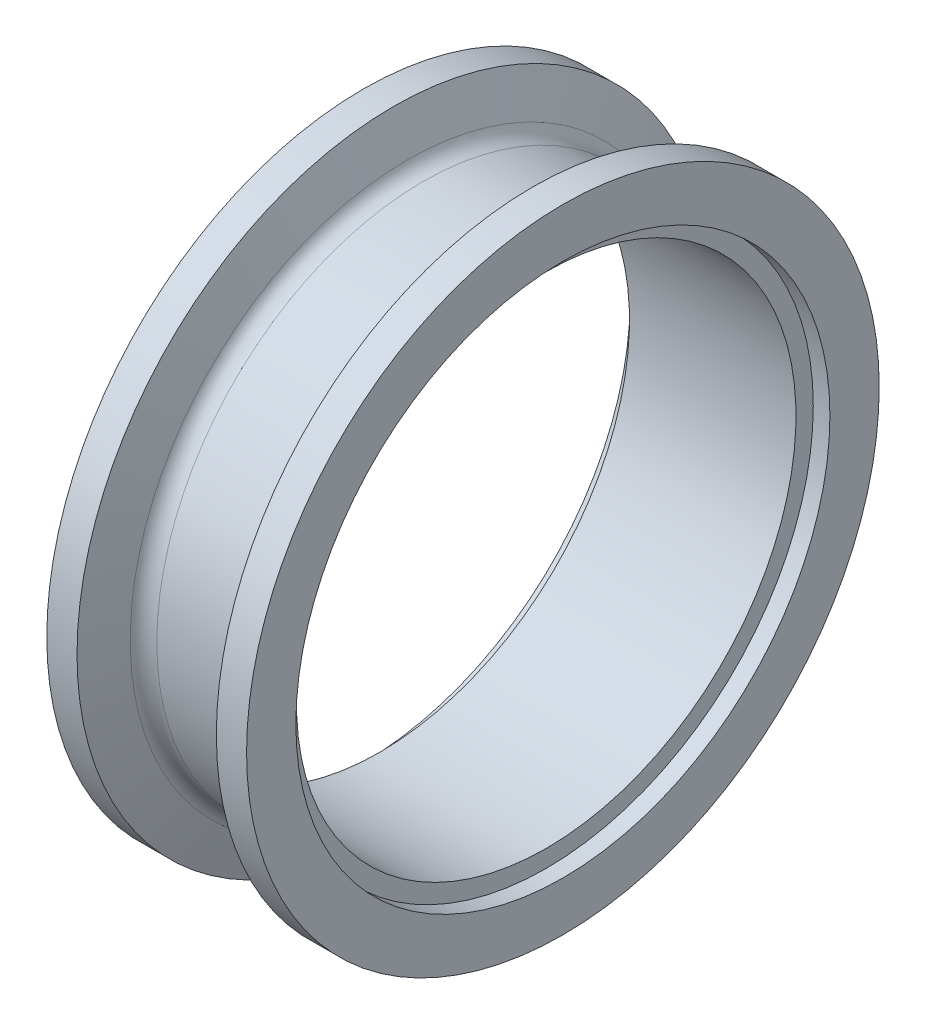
ISO-10303-21;
HEADER;
FILE_DESCRIPTION(('STEP AP214'),'2;1');
FILE_NAME('part.step','',(''),(''),'','','');
FILE_SCHEMA(('AUTOMOTIVE_DESIGN { 1 0 10303 214 1 1 1 1 }'));
ENDSEC;
DATA;
#1=APPLICATION_CONTEXT('core data for automotive mechanical design processes');
#2=APPLICATION_PROTOCOL_DEFINITION('international standard','automotive_design',2000,#1);
#3=PRODUCT_CONTEXT('',#1,'mechanical');
#4=PRODUCT('Part','Part','',(#3));
#5=PRODUCT_RELATED_PRODUCT_CATEGORY('part','',(#4));
#6=PRODUCT_DEFINITION_FORMATION('','',#4);
#7=PRODUCT_DEFINITION_CONTEXT('part definition',#1,'design');
#8=PRODUCT_DEFINITION('design','',#6,#7);
#9=PRODUCT_DEFINITION_SHAPE('','',#8);
#10=(LENGTH_UNIT() NAMED_UNIT(*) SI_UNIT(.MILLI.,.METRE.));
#11=(NAMED_UNIT(*) PLANE_ANGLE_UNIT() SI_UNIT($,.RADIAN.));
#12=(NAMED_UNIT(*) SI_UNIT($,.STERADIAN.) SOLID_ANGLE_UNIT());
#13=UNCERTAINTY_MEASURE_WITH_UNIT(LENGTH_MEASURE(1.E-05),#10,'distance_accuracy_value','');
#14=(GEOMETRIC_REPRESENTATION_CONTEXT(3) GLOBAL_UNCERTAINTY_ASSIGNED_CONTEXT((#13)) GLOBAL_UNIT_ASSIGNED_CONTEXT((#10,
#11,#12)) REPRESENTATION_CONTEXT('',''));
#15=CARTESIAN_POINT('',(0.,0.,0.));
#16=DIRECTION('',(0.,0.,1.));
#17=DIRECTION('',(1.,0.,0.));
#18=AXIS2_PLACEMENT_3D('',#15,#16,#17);
#19=CARTESIAN_POINT('',(0.,60.325,0.));
#20=DIRECTION('',(-1.,0.,0.));
#21=DIRECTION('',(0.,-1.,0.));
#22=AXIS2_PLACEMENT_3D('',#19,#20,#21);
#23=PLANE('',#22);
#24=CARTESIAN_POINT('',(0.,0.,0.));
#25=DIRECTION('',(1.,0.,0.));
#26=DIRECTION('',(0.,1.,0.));
#27=AXIS2_PLACEMENT_3D('',#24,#25,#26);
#28=CIRCLE('',#27,50.927);
#29=CARTESIAN_POINT('',(0.,50.927,0.));
#30=VERTEX_POINT('',#29);
#31=EDGE_CURVE('E80',#30,#30,#28,.T.);
#32=ORIENTED_EDGE('',*,*,#31,.T.);
#33=EDGE_LOOP('',(#32));
#34=FACE_BOUND('',#33,.T.);
#35=CARTESIAN_POINT('',(0.,0.,0.));
#36=DIRECTION('',(1.,0.,0.));
#37=DIRECTION('',(0.,1.,0.));
#38=AXIS2_PLACEMENT_3D('',#35,#36,#37);
#39=CIRCLE('',#38,60.325);
#40=CARTESIAN_POINT('',(0.,60.325,0.));
#41=VERTEX_POINT('',#40);
#42=EDGE_CURVE('E10',#41,#41,#39,.T.);
#43=ORIENTED_EDGE('',*,*,#42,.F.);
#44=EDGE_LOOP('',(#43));
#45=FACE_BOUND('',#44,.T.);
#46=ADVANCED_FACE('F34',(#34,#45),#23,.T.);
#47=CARTESIAN_POINT('',(19.0500000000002,0.,0.));
#48=DIRECTION('',(1.,0.,0.));
#49=DIRECTION('',(0.,1.,0.));
#50=AXIS2_PLACEMENT_3D('',#47,#48,#49);
#51=CYLINDRICAL_SURFACE('',#50,60.325);
#52=ORIENTED_EDGE('',*,*,#42,.T.);
#53=EDGE_LOOP('',(#52));
#54=FACE_BOUND('',#53,.T.);
#55=CARTESIAN_POINT('',(5.76579999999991,0.,0.));
#56=DIRECTION('',(1.,0.,0.));
#57=DIRECTION('',(0.,1.,0.));
#58=AXIS2_PLACEMENT_3D('',#55,#56,#57);
#59=CIRCLE('',#58,60.325);
#60=CARTESIAN_POINT('',(5.7658,60.325,0.));
#61=VERTEX_POINT('',#60);
#62=EDGE_CURVE('E40',#61,#61,#59,.T.);
#63=ORIENTED_EDGE('',*,*,#62,.F.);
#64=EDGE_LOOP('',(#63));
#65=FACE_BOUND('',#64,.T.);
#66=ADVANCED_FACE('F98',(#54,#65),#51,.T.);
#67=CARTESIAN_POINT('',(8.47225134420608,0.,0.));
#68=DIRECTION('',(-1.,0.,0.));
#69=DIRECTION('',(0.,-1.,0.));
#70=AXIS2_PLACEMENT_3D('',#67,#68,#69);
#71=CONICAL_SURFACE('',#70,52.889086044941,1.22173047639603);
#72=ORIENTED_EDGE('',*,*,#62,.T.);
#73=EDGE_LOOP('',(#72));
#74=FACE_BOUND('',#73,.T.);
#75=CARTESIAN_POINT('',(8.47225134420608,0.,0.));
#76=DIRECTION('',(1.,0.,0.));
#77=DIRECTION('',(0.,1.,0.));
#78=AXIS2_PLACEMENT_3D('',#75,#76,#77);
#79=CIRCLE('',#78,52.889086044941);
#80=CARTESIAN_POINT('',(8.47225134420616,52.8890860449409,0.));
#81=VERTEX_POINT('',#80);
#82=EDGE_CURVE('E44',#81,#81,#79,.T.);
#83=ORIENTED_EDGE('',*,*,#82,.F.);
#84=EDGE_LOOP('',(#83));
#85=FACE_BOUND('',#84,.T.);
#86=ADVANCED_FACE('F102',(#74,#85),#71,.T.);
#87=CARTESIAN_POINT('',(11.4557754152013,0.,0.));
#88=DIRECTION('',(1.,0.,0.));
#89=DIRECTION('',(0.,1.,0.));
#90=AXIS2_PLACEMENT_3D('',#87,#88,#89);
#91=TOROIDAL_SURFACE('',#90,53.975,3.175);
#92=ORIENTED_EDGE('',*,*,#82,.T.);
#93=EDGE_LOOP('',(#92));
#94=FACE_BOUND('',#93,.T.);
#95=CARTESIAN_POINT('',(11.4557754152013,0.,0.));
#96=DIRECTION('',(1.,0.,0.));
#97=DIRECTION('',(0.,1.,0.));
#98=AXIS2_PLACEMENT_3D('',#95,#96,#97);
#99=CIRCLE('',#98,50.8);
#100=CARTESIAN_POINT('',(11.4557754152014,50.7999999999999,0.));
#101=VERTEX_POINT('',#100);
#102=EDGE_CURVE('E48',#101,#101,#99,.T.);
#103=ORIENTED_EDGE('',*,*,#102,.F.);
#104=EDGE_LOOP('',(#103));
#105=FACE_BOUND('',#104,.T.);
#106=ADVANCED_FACE('F106',(#94,#105),#91,.F.);
#107=CARTESIAN_POINT('',(19.0500000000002,0.,0.));
#108=DIRECTION('',(1.,0.,0.));
#109=DIRECTION('',(0.,1.,0.));
#110=AXIS2_PLACEMENT_3D('',#107,#108,#109);
#111=CYLINDRICAL_SURFACE('',#110,50.8);
#112=ORIENTED_EDGE('',*,*,#102,.T.);
#113=EDGE_LOOP('',(#112));
#114=FACE_BOUND('',#113,.T.);
#115=CARTESIAN_POINT('',(26.6442245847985,0.,0.));
#116=DIRECTION('',(1.,0.,0.));
#117=DIRECTION('',(0.,1.,0.));
#118=AXIS2_PLACEMENT_3D('',#115,#116,#117);
#119=CIRCLE('',#118,50.8);
#120=CARTESIAN_POINT('',(26.6442245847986,50.7999999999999,0.));
#121=VERTEX_POINT('',#120);
#122=EDGE_CURVE('E53',#121,#121,#119,.T.);
#123=ORIENTED_EDGE('',*,*,#122,.F.);
#124=EDGE_LOOP('',(#123));
#125=FACE_BOUND('',#124,.T.);
#126=ADVANCED_FACE('F112',(#114,#125),#111,.T.);
#127=CARTESIAN_POINT('',(26.6442245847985,0.,0.));
#128=DIRECTION('',(1.,0.,0.));
#129=DIRECTION('',(0.,1.,0.));
#130=AXIS2_PLACEMENT_3D('',#127,#128,#129);
#131=TOROIDAL_SURFACE('',#130,53.975,3.175);
#132=ORIENTED_EDGE('',*,*,#122,.T.);
#133=EDGE_LOOP('',(#132));
#134=FACE_BOUND('',#133,.T.);
#135=CARTESIAN_POINT('',(29.6277486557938,0.,0.));
#136=DIRECTION('',(1.,0.,0.));
#137=DIRECTION('',(0.,1.,0.));
#138=AXIS2_PLACEMENT_3D('',#135,#136,#137);
#139=CIRCLE('',#138,52.889086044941);
#140=CARTESIAN_POINT('',(29.6277486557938,52.889086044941,0.));
#141=VERTEX_POINT('',#140);
#142=EDGE_CURVE('E56',#141,#141,#139,.T.);
#143=ORIENTED_EDGE('',*,*,#142,.F.);
#144=EDGE_LOOP('',(#143));
#145=FACE_BOUND('',#144,.T.);
#146=ADVANCED_FACE('F116',(#134,#145),#131,.F.);
#147=CARTESIAN_POINT('',(32.3341999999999,0.,0.));
#148=DIRECTION('',(1.,0.,0.));
#149=DIRECTION('',(0.,1.,0.));
#150=AXIS2_PLACEMENT_3D('',#147,#148,#149);
#151=CONICAL_SURFACE('',#150,60.3250000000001,1.22173047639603);
#152=ORIENTED_EDGE('',*,*,#142,.T.);
#153=EDGE_LOOP('',(#152));
#154=FACE_BOUND('',#153,.T.);
#155=CARTESIAN_POINT('',(32.3341999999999,0.,0.));
#156=DIRECTION('',(1.,0.,0.));
#157=DIRECTION('',(0.,1.,0.));
#158=AXIS2_PLACEMENT_3D('',#155,#156,#157);
#159=CIRCLE('',#158,60.3250000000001);
#160=CARTESIAN_POINT('',(32.3342,60.325,0.));
#161=VERTEX_POINT('',#160);
#162=EDGE_CURVE('E59',#161,#161,#159,.T.);
#163=ORIENTED_EDGE('',*,*,#162,.F.);
#164=EDGE_LOOP('',(#163));
#165=FACE_BOUND('',#164,.T.);
#166=ADVANCED_FACE('F120',(#154,#165),#151,.T.);
#167=CARTESIAN_POINT('',(19.0500000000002,0.,0.));
#168=DIRECTION('',(1.,0.,0.));
#169=DIRECTION('',(0.,1.,0.));
#170=AXIS2_PLACEMENT_3D('',#167,#168,#169);
#171=CYLINDRICAL_SURFACE('',#170,60.3250000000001);
#172=ORIENTED_EDGE('',*,*,#162,.T.);
#173=EDGE_LOOP('',(#172));
#174=FACE_BOUND('',#173,.T.);
#175=CARTESIAN_POINT('',(38.0999999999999,0.,0.));
#176=DIRECTION('',(1.,0.,0.));
#177=DIRECTION('',(0.,1.,0.));
#178=AXIS2_PLACEMENT_3D('',#175,#176,#177);
#179=CIRCLE('',#178,60.3250000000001);
#180=CARTESIAN_POINT('',(38.1,60.325,0.));
#181=VERTEX_POINT('',#180);
#182=EDGE_CURVE('E62',#181,#181,#179,.T.);
#183=ORIENTED_EDGE('',*,*,#182,.F.);
#184=EDGE_LOOP('',(#183));
#185=FACE_BOUND('',#184,.T.);
#186=ADVANCED_FACE('F124',(#174,#185),#171,.T.);
#187=CARTESIAN_POINT('',(38.1,60.325,0.));
#188=DIRECTION('',(1.,0.,0.));
#189=DIRECTION('',(0.,1.,0.));
#190=AXIS2_PLACEMENT_3D('',#187,#188,#189);
#191=PLANE('',#190);
#192=ORIENTED_EDGE('',*,*,#182,.T.);
#193=EDGE_LOOP('',(#192));
#194=FACE_BOUND('',#193,.T.);
#195=CARTESIAN_POINT('',(38.0999999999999,0.,0.));
#196=DIRECTION('',(1.,0.,0.));
#197=DIRECTION('',(0.,1.,0.));
#198=AXIS2_PLACEMENT_3D('',#195,#196,#197);
#199=CIRCLE('',#198,50.9270000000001);
#200=CARTESIAN_POINT('',(38.1,50.927,0.));
#201=VERTEX_POINT('',#200);
#202=EDGE_CURVE('E65',#201,#201,#199,.T.);
#203=ORIENTED_EDGE('',*,*,#202,.F.);
#204=EDGE_LOOP('',(#203));
#205=FACE_BOUND('',#204,.T.);
#206=ADVANCED_FACE('F128',(#194,#205),#191,.T.);
#207=CARTESIAN_POINT('',(19.0500000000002,0.,0.));
#208=DIRECTION('',(1.,0.,0.));
#209=DIRECTION('',(0.,1.,0.));
#210=AXIS2_PLACEMENT_3D('',#207,#208,#209);
#211=CYLINDRICAL_SURFACE('',#210,50.9270000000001);
#212=ORIENTED_EDGE('',*,*,#202,.T.);
#213=EDGE_LOOP('',(#212));
#214=FACE_BOUND('',#213,.T.);
#215=CARTESIAN_POINT('',(34.9249999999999,0.,0.));
#216=DIRECTION('',(1.,0.,0.));
#217=DIRECTION('',(0.,1.,0.));
#218=AXIS2_PLACEMENT_3D('',#215,#216,#217);
#219=CIRCLE('',#218,50.927);
#220=CARTESIAN_POINT('',(34.925,50.927,0.));
#221=VERTEX_POINT('',#220);
#222=EDGE_CURVE('E68',#221,#221,#219,.T.);
#223=ORIENTED_EDGE('',*,*,#222,.F.);
#224=EDGE_LOOP('',(#223));
#225=FACE_BOUND('',#224,.T.);
#226=ADVANCED_FACE('F132',(#214,#225),#211,.F.);
#227=CARTESIAN_POINT('',(34.925,50.927,0.));
#228=DIRECTION('',(1.,0.,0.));
#229=DIRECTION('',(0.,1.,0.));
#230=AXIS2_PLACEMENT_3D('',#227,#228,#229);
#231=PLANE('',#230);
#232=ORIENTED_EDGE('',*,*,#222,.T.);
#233=EDGE_LOOP('',(#232));
#234=FACE_BOUND('',#233,.T.);
#235=CARTESIAN_POINT('',(34.9249999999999,0.,0.));
#236=DIRECTION('',(1.,0.,0.));
#237=DIRECTION('',(0.,1.,0.));
#238=AXIS2_PLACEMENT_3D('',#235,#236,#237);
#239=CIRCLE('',#238,47.625);
#240=CARTESIAN_POINT('',(34.925,47.625,0.));
#241=VERTEX_POINT('',#240);
#242=EDGE_CURVE('E71',#241,#241,#239,.T.);
#243=ORIENTED_EDGE('',*,*,#242,.F.);
#244=EDGE_LOOP('',(#243));
#245=FACE_BOUND('',#244,.T.);
#246=ADVANCED_FACE('F136',(#234,#245),#231,.T.);
#247=CARTESIAN_POINT('',(19.0500000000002,0.,0.));
#248=DIRECTION('',(1.,0.,0.));
#249=DIRECTION('',(0.,1.,0.));
#250=AXIS2_PLACEMENT_3D('',#247,#248,#249);
#251=CYLINDRICAL_SURFACE('',#250,47.625);
#252=ORIENTED_EDGE('',*,*,#242,.T.);
#253=EDGE_LOOP('',(#252));
#254=FACE_BOUND('',#253,.T.);
#255=CARTESIAN_POINT('',(3.17499999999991,0.,0.));
#256=DIRECTION('',(1.,0.,0.));
#257=DIRECTION('',(0.,1.,0.));
#258=AXIS2_PLACEMENT_3D('',#255,#256,#257);
#259=CIRCLE('',#258,47.6249999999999);
#260=CARTESIAN_POINT('',(3.17499999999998,47.6249999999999,0.));
#261=VERTEX_POINT('',#260);
#262=EDGE_CURVE('E74',#261,#261,#259,.T.);
#263=ORIENTED_EDGE('',*,*,#262,.F.);
#264=EDGE_LOOP('',(#263));
#265=FACE_BOUND('',#264,.T.);
#266=ADVANCED_FACE('F94',(#254,#265),#251,.F.);
#267=CARTESIAN_POINT('',(3.17499999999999,50.927,0.));
#268=DIRECTION('',(-1.,0.,0.));
#269=DIRECTION('',(0.,-1.,0.));
#270=AXIS2_PLACEMENT_3D('',#267,#268,#269);
#271=PLANE('',#270);
#272=ORIENTED_EDGE('',*,*,#262,.T.);
#273=EDGE_LOOP('',(#272));
#274=FACE_BOUND('',#273,.T.);
#275=CARTESIAN_POINT('',(3.17499999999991,0.,0.));
#276=DIRECTION('',(1.,0.,0.));
#277=DIRECTION('',(0.,1.,0.));
#278=AXIS2_PLACEMENT_3D('',#275,#276,#277);
#279=CIRCLE('',#278,50.927);
#280=CARTESIAN_POINT('',(3.17499999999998,50.927,0.));
#281=VERTEX_POINT('',#280);
#282=EDGE_CURVE('E77',#281,#281,#279,.T.);
#283=ORIENTED_EDGE('',*,*,#282,.F.);
#284=EDGE_LOOP('',(#283));
#285=FACE_BOUND('',#284,.T.);
#286=ADVANCED_FACE('F88',(#274,#285),#271,.T.);
#287=CARTESIAN_POINT('',(19.0500000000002,0.,0.));
#288=DIRECTION('',(1.,0.,0.));
#289=DIRECTION('',(0.,1.,0.));
#290=AXIS2_PLACEMENT_3D('',#287,#288,#289);
#291=CYLINDRICAL_SURFACE('',#290,50.927);
#292=ORIENTED_EDGE('',*,*,#282,.T.);
#293=EDGE_LOOP('',(#292));
#294=FACE_BOUND('',#293,.T.);
#295=ORIENTED_EDGE('',*,*,#31,.F.);
#296=EDGE_LOOP('',(#295));
#297=FACE_BOUND('',#296,.T.);
#298=ADVANCED_FACE('F86',(#294,#297),#291,.F.);
#299=CLOSED_SHELL('',(#46,#66,#86,#106,#126,#146,#166,#186,#206,#226,#246,#266,#286,#298));
#300=MANIFOLD_SOLID_BREP('B2',#299);
#301=ADVANCED_BREP_SHAPE_REPRESENTATION('',(#18,#300),#14);
#302=SHAPE_DEFINITION_REPRESENTATION(#9,#301);
ENDSEC;
END-ISO-10303-21;
